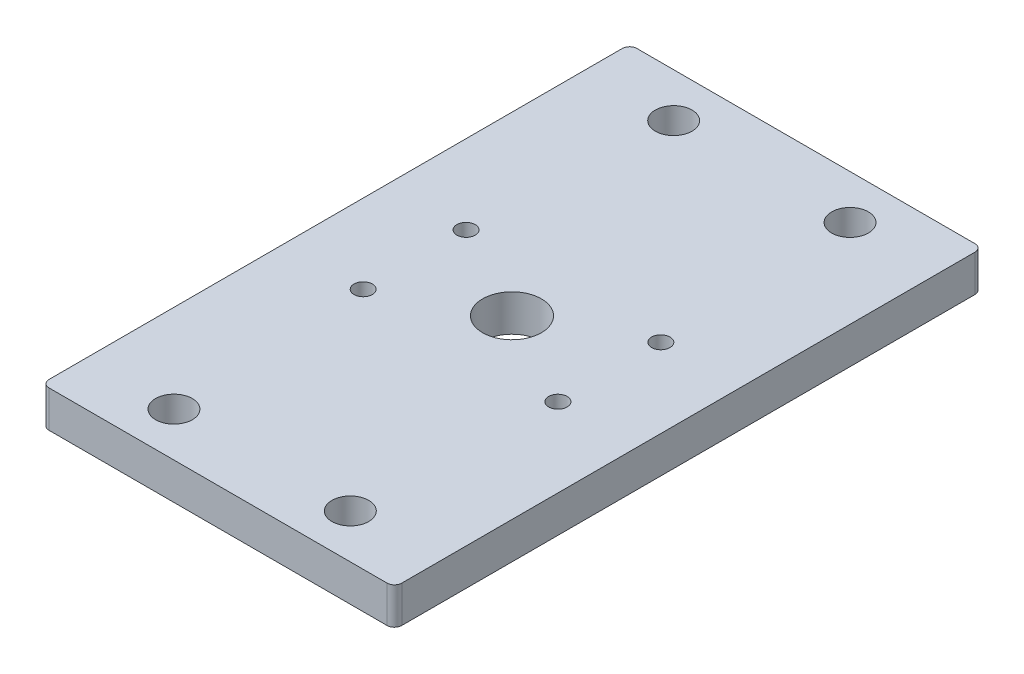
from build123d import *

# Parameters (mm, degrees)
SKETCH2_W          = 304.8
SKETCH2_H          = 508
BASE_EXTRUDE_DEPTH = 31.75
SKETCH3_R          = 25.4
CUT_EXTRUDE1_DEPTH = 532.317064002
SKETCH4_R          = 15.875
SKETCH4_R_2        = 7.9375
CUT_EXTRUDE2_DEPTH = 532.317064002
FILLET1_R          = 6.35


with BuildPart() as part:
    # Sketch2 → Base-Extrude (new body)
    with BuildSketch(Plane(origin=(0, 0, 0), x_dir=(1, 0, 0), z_dir=(0, 1, 0))):
        with Locations((0, -254)):
            Rectangle(SKETCH2_W, SKETCH2_H)
    extrude(amount=BASE_EXTRUDE_DEPTH)

    # Sketch3 → Cut-Extrude1 (cut, through all)
    with BuildSketch(Plane(origin=(0, 31.75, 0), x_dir=(-1, 0, 0), z_dir=(0, 1, 0))):
        with Locations(Location((0, 254, 0), (0, 0, 90))):
            Circle(SKETCH3_R)
    extrude(amount=-CUT_EXTRUDE1_DEPTH, mode=Mode.SUBTRACT)

    # Sketch4 → Cut-Extrude2 (cut, through all)
    with BuildSketch(Plane.XZ):
        with Locations(Location((-76.2, 38.1, 0), (0, 0, 270))):
            Circle(SKETCH4_R)
        with Locations(Location((76.2, 38.1, 0), (0, 0, 270))):
            Circle(SKETCH4_R)
        with Locations(Location((-76.2, 469.9, 0), (0, 0, 270))):
            Circle(SKETCH4_R)
        with Locations(Location((76.2, 469.9, 0), (0, 0, 270))):
            Circle(SKETCH4_R)
        with Locations(Location((-84.1375, 209.55, 0), (0, 0, 270))):
            Circle(SKETCH4_R_2)
        with Locations(Location((-84.1375, 298.45, 0), (0, 0, 270))):
            Circle(SKETCH4_R_2)
        with Locations(Location((84.1375, 298.45, 0), (0, 0, 270))):
            Circle(SKETCH4_R_2)
        with Locations(Location((84.1375, 209.55, 0), (0, 0, 270))):
            Circle(SKETCH4_R_2)
    extrude(amount=-CUT_EXTRUDE2_DEPTH, mode=Mode.SUBTRACT)

    # Fillet1
    fillet1_edges = [part.edges().sort_by_distance(p)[0] for p in [
        (152.4, 15.875, 0),
        (-152.4, 15.875, 0),
        (-152.4, 15.875, 508),
        (152.4, 15.875, 508),
    ]]
    fillet(fillet1_edges, radius=FILLET1_R)


solid = part.part
